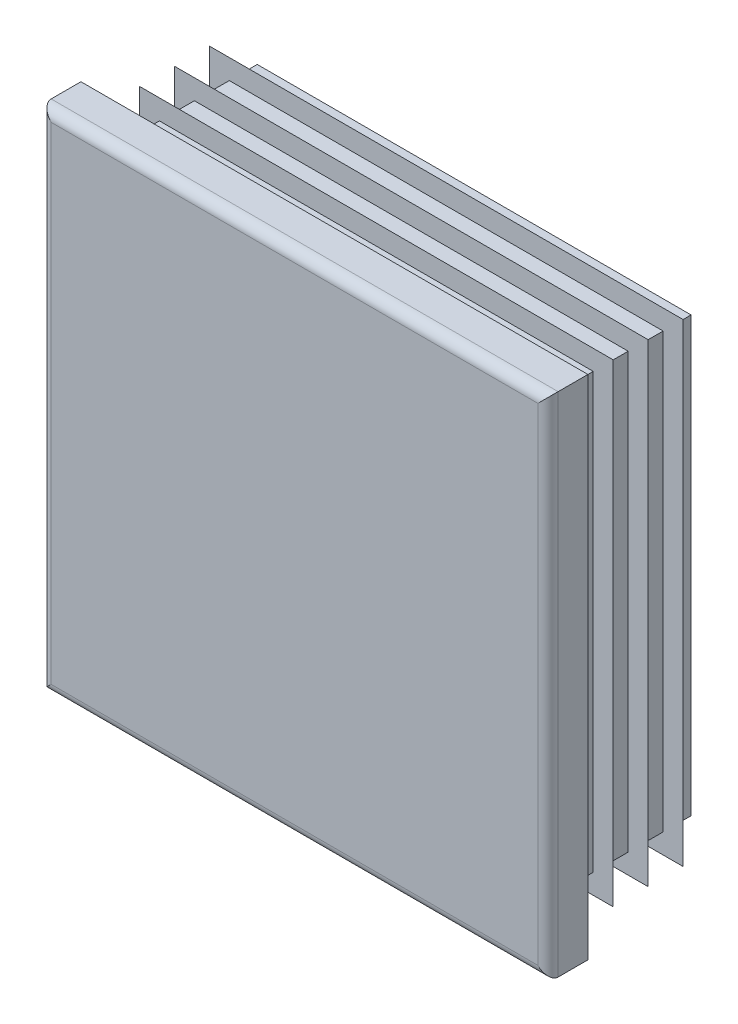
ISO-10303-21;
HEADER;
FILE_DESCRIPTION(('STEP AP214'),'2;1');
FILE_NAME('part.step','',(''),(''),'','','');
FILE_SCHEMA(('AUTOMOTIVE_DESIGN { 1 0 10303 214 1 1 1 1 }'));
ENDSEC;
DATA;
#1=APPLICATION_CONTEXT('core data for automotive mechanical design processes');
#2=APPLICATION_PROTOCOL_DEFINITION('international standard','automotive_design',2000,#1);
#3=PRODUCT_CONTEXT('',#1,'mechanical');
#4=PRODUCT('Part','Part','',(#3));
#5=PRODUCT_RELATED_PRODUCT_CATEGORY('part','',(#4));
#6=PRODUCT_DEFINITION_FORMATION('','',#4);
#7=PRODUCT_DEFINITION_CONTEXT('part definition',#1,'design');
#8=PRODUCT_DEFINITION('design','',#6,#7);
#9=PRODUCT_DEFINITION_SHAPE('','',#8);
#10=(LENGTH_UNIT() NAMED_UNIT(*) SI_UNIT(.MILLI.,.METRE.));
#11=(NAMED_UNIT(*) PLANE_ANGLE_UNIT() SI_UNIT($,.RADIAN.));
#12=(NAMED_UNIT(*) SI_UNIT($,.STERADIAN.) SOLID_ANGLE_UNIT());
#13=UNCERTAINTY_MEASURE_WITH_UNIT(LENGTH_MEASURE(1.E-05),#10,'distance_accuracy_value','');
#14=(GEOMETRIC_REPRESENTATION_CONTEXT(3) GLOBAL_UNCERTAINTY_ASSIGNED_CONTEXT((#13)) GLOBAL_UNIT_ASSIGNED_CONTEXT((#10,
#11,#12)) REPRESENTATION_CONTEXT('',''));
#15=CARTESIAN_POINT('',(0.,0.,0.));
#16=DIRECTION('',(0.,0.,1.));
#17=DIRECTION('',(1.,0.,0.));
#18=AXIS2_PLACEMENT_3D('',#15,#16,#17);
#19=CARTESIAN_POINT('',(36.576,-38.1,6.));
#20=DIRECTION('',(0.,0.,-1.));
#21=DIRECTION('',(0.,1.,0.));
#22=AXIS2_PLACEMENT_3D('',#19,#20,#21);
#23=PLANE('',#22);
#24=DIRECTION('',(0.,1.,0.));
#25=VECTOR('',#24,1.);
#26=CARTESIAN_POINT('',(-36.576,-38.1,6.));
#27=LINE('',#26,#25);
#28=CARTESIAN_POINT('',(-36.576,-36.576,6.));
#29=VERTEX_POINT('',#28);
#30=CARTESIAN_POINT('',(-36.576,36.576,6.));
#31=VERTEX_POINT('',#30);
#32=EDGE_CURVE('E262',#29,#31,#27,.T.);
#33=ORIENTED_EDGE('',*,*,#32,.F.);
#34=DIRECTION('',(-1.,0.,0.));
#35=VECTOR('',#34,1.);
#36=CARTESIAN_POINT('',(38.1,-36.576,6.));
#37=LINE('',#36,#35);
#38=CARTESIAN_POINT('',(36.576,-36.576,6.));
#39=VERTEX_POINT('',#38);
#40=EDGE_CURVE('E432',#39,#29,#37,.T.);
#41=ORIENTED_EDGE('',*,*,#40,.F.);
#42=DIRECTION('',(0.,1.,0.));
#43=VECTOR('',#42,1.);
#44=CARTESIAN_POINT('',(36.576,-38.1,6.));
#45=LINE('',#44,#43);
#46=CARTESIAN_POINT('',(36.576,36.576,6.));
#47=VERTEX_POINT('',#46);
#48=EDGE_CURVE('E257',#39,#47,#45,.T.);
#49=ORIENTED_EDGE('',*,*,#48,.T.);
#50=DIRECTION('',(-1.,0.,0.));
#51=VECTOR('',#50,1.);
#52=CARTESIAN_POINT('',(38.1,36.576,6.));
#53=LINE('',#52,#51);
#54=EDGE_CURVE('E534',#47,#31,#53,.T.);
#55=ORIENTED_EDGE('',*,*,#54,.T.);
#56=EDGE_LOOP('',(#33,#41,#49,#55));
#57=FACE_BOUND('',#56,.T.);
#58=ADVANCED_FACE('F14',(#57),#23,.F.);
#59=CARTESIAN_POINT('',(-36.576,-38.1,4.476));
#60=DIRECTION('',(0.,1.,0.));
#61=DIRECTION('',(-1.,0.,0.));
#62=AXIS2_PLACEMENT_3D('',#59,#60,#61);
#63=CYLINDRICAL_SURFACE('',#62,1.524);
#64=DIRECTION('',(0.,1.,0.));
#65=VECTOR('',#64,1.);
#66=CARTESIAN_POINT('',(-38.1,-38.1,4.476));
#67=LINE('',#66,#65);
#68=CARTESIAN_POINT('',(-38.1,-38.1,4.476));
#69=VERTEX_POINT('',#68);
#70=CARTESIAN_POINT('',(-38.1,38.1,4.476));
#71=VERTEX_POINT('',#70);
#72=EDGE_CURVE('E354',#69,#71,#67,.T.);
#73=ORIENTED_EDGE('',*,*,#72,.F.);
#74=CARTESIAN_POINT('',(-36.576,-36.576,4.476));
#75=DIRECTION('',(-0.707106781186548,0.707106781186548,0.));
#76=DIRECTION('',(0.707106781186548,0.707106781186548,0.));
#77=AXIS2_PLACEMENT_3D('',#74,#75,#76);
#78=ELLIPSE('',#77,2.15526146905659,1.524);
#79=EDGE_CURVE('E59',#69,#29,#78,.T.);
#80=ORIENTED_EDGE('',*,*,#79,.T.);
#81=ORIENTED_EDGE('',*,*,#32,.T.);
#82=CARTESIAN_POINT('',(-36.576,36.576,4.476));
#83=DIRECTION('',(0.707106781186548,0.707106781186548,0.));
#84=DIRECTION('',(-0.707106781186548,0.707106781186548,0.));
#85=AXIS2_PLACEMENT_3D('',#82,#83,#84);
#86=ELLIPSE('',#85,2.1552614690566,1.524);
#87=EDGE_CURVE('E258',#31,#71,#86,.F.);
#88=ORIENTED_EDGE('',*,*,#87,.T.);
#89=EDGE_LOOP('',(#73,#80,#81,#88));
#90=FACE_BOUND('',#89,.T.);
#91=ADVANCED_FACE('F16',(#90),#63,.T.);
#92=CARTESIAN_POINT('',(-38.1,-38.1,4.476));
#93=DIRECTION('',(1.,0.,0.));
#94=DIRECTION('',(0.,1.,0.));
#95=AXIS2_PLACEMENT_3D('',#92,#93,#94);
#96=PLANE('',#95);
#97=DIRECTION('',(0.,0.,-1.));
#98=VECTOR('',#97,1.);
#99=CARTESIAN_POINT('',(-38.1,38.1,4.476));
#100=LINE('',#99,#98);
#101=CARTESIAN_POINT('',(-38.1,38.1,0.));
#102=VERTEX_POINT('',#101);
#103=EDGE_CURVE('E519',#71,#102,#100,.T.);
#104=ORIENTED_EDGE('',*,*,#103,.T.);
#105=DIRECTION('',(0.,1.,0.));
#106=VECTOR('',#105,1.);
#107=CARTESIAN_POINT('',(-38.1,-38.1,0.));
#108=LINE('',#107,#106);
#109=CARTESIAN_POINT('',(-38.1,-38.1,0.));
#110=VERTEX_POINT('',#109);
#111=EDGE_CURVE('E352',#110,#102,#108,.T.);
#112=ORIENTED_EDGE('',*,*,#111,.F.);
#113=DIRECTION('',(0.,0.,-1.));
#114=VECTOR('',#113,1.);
#115=CARTESIAN_POINT('',(-38.1,-38.1,4.476));
#116=LINE('',#115,#114);
#117=EDGE_CURVE('E520',#69,#110,#116,.T.);
#118=ORIENTED_EDGE('',*,*,#117,.F.);
#119=ORIENTED_EDGE('',*,*,#72,.T.);
#120=EDGE_LOOP('',(#104,#112,#118,#119));
#121=FACE_BOUND('',#120,.T.);
#122=ADVANCED_FACE('F604',(#121),#96,.F.);
#123=CARTESIAN_POINT('',(-32.6,-38.1,0.));
#124=DIRECTION('',(1.,0.,0.));
#125=DIRECTION('',(0.,1.,0.));
#126=AXIS2_PLACEMENT_3D('',#123,#124,#125);
#127=PLANE('',#126);
#128=DIRECTION('',(0.,1.,0.));
#129=VECTOR('',#128,1.);
#130=CARTESIAN_POINT('',(-32.6,-38.1,0.));
#131=LINE('',#130,#129);
#132=CARTESIAN_POINT('',(-32.6,-32.6,0.));
#133=VERTEX_POINT('',#132);
#134=CARTESIAN_POINT('',(-32.6,32.6,0.));
#135=VERTEX_POINT('',#134);
#136=EDGE_CURVE('E349',#133,#135,#131,.T.);
#137=ORIENTED_EDGE('',*,*,#136,.T.);
#138=DIRECTION('',(0.,0.,-1.));
#139=VECTOR('',#138,1.);
#140=CARTESIAN_POINT('',(-32.6,32.6,0.));
#141=LINE('',#140,#139);
#142=CARTESIAN_POINT('',(-32.6,32.6,-1.05));
#143=VERTEX_POINT('',#142);
#144=EDGE_CURVE('E445',#135,#143,#141,.T.);
#145=ORIENTED_EDGE('',*,*,#144,.T.);
#146=DIRECTION('',(0.,1.,0.));
#147=VECTOR('',#146,1.);
#148=CARTESIAN_POINT('',(-32.6,-38.1,-1.05));
#149=LINE('',#148,#147);
#150=CARTESIAN_POINT('',(-32.6,-32.6,-1.05));
#151=VERTEX_POINT('',#150);
#152=EDGE_CURVE('E346',#151,#143,#149,.T.);
#153=ORIENTED_EDGE('',*,*,#152,.F.);
#154=DIRECTION('',(0.,0.,1.));
#155=VECTOR('',#154,1.);
#156=CARTESIAN_POINT('',(-32.6,-32.6,0.));
#157=LINE('',#156,#155);
#158=EDGE_CURVE('E439',#151,#133,#157,.T.);
#159=ORIENTED_EDGE('',*,*,#158,.T.);
#160=EDGE_LOOP('',(#137,#145,#153,#159));
#161=FACE_BOUND('',#160,.T.);
#162=ADVANCED_FACE('F728',(#161),#127,.F.);
#163=CARTESIAN_POINT('',(-35.6,-38.1,-1.05));
#164=DIRECTION('',(0.573576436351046,0.,0.819152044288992));
#165=DIRECTION('',(-0.819152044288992,0.,0.573576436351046));
#166=AXIS2_PLACEMENT_3D('',#163,#164,#165);
#167=PLANE('',#166);
#168=DIRECTION('',(0.,1.,0.));
#169=VECTOR('',#168,1.);
#170=CARTESIAN_POINT('',(-35.6,-38.1,-1.05));
#171=LINE('',#170,#169);
#172=CARTESIAN_POINT('',(-35.6,-35.6,-1.05));
#173=VERTEX_POINT('',#172);
#174=CARTESIAN_POINT('',(-35.6,35.6,-1.05));
#175=VERTEX_POINT('',#174);
#176=EDGE_CURVE('E344',#173,#175,#171,.T.);
#177=ORIENTED_EDGE('',*,*,#176,.T.);
#178=DIRECTION('',(0.633687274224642,-0.633687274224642,-0.443712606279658));
#179=VECTOR('',#178,1.);
#180=CARTESIAN_POINT('',(-6.0050603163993,6.00506031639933,-21.7725998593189));
#181=LINE('',#180,#179);
#182=CARTESIAN_POINT('',(-32.6,32.6,-3.15062261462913));
#183=VERTEX_POINT('',#182);
#184=EDGE_CURVE('E457',#175,#183,#181,.T.);
#185=ORIENTED_EDGE('',*,*,#184,.T.);
#186=DIRECTION('',(0.,1.,0.));
#187=VECTOR('',#186,1.);
#188=CARTESIAN_POINT('',(-32.6,-38.1,-3.15062261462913));
#189=LINE('',#188,#187);
#190=CARTESIAN_POINT('',(-32.6,-32.6,-3.15062261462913));
#191=VERTEX_POINT('',#190);
#192=EDGE_CURVE('E341',#191,#183,#189,.T.);
#193=ORIENTED_EDGE('',*,*,#192,.F.);
#194=DIRECTION('',(-0.633687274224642,-0.633687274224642,0.443712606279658));
#195=VECTOR('',#194,1.);
#196=CARTESIAN_POINT('',(-36.6038989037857,-36.6038989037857,-0.347062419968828));
#197=LINE('',#196,#195);
#198=EDGE_CURVE('E451',#191,#173,#197,.T.);
#199=ORIENTED_EDGE('',*,*,#198,.T.);
#200=EDGE_LOOP('',(#177,#185,#193,#199));
#201=FACE_BOUND('',#200,.T.);
#202=ADVANCED_FACE('F732',(#201),#167,.F.);
#203=CARTESIAN_POINT('',(-32.6,-38.1,-3.15062261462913));
#204=DIRECTION('',(1.,0.,0.));
#205=DIRECTION('',(0.,1.,0.));
#206=AXIS2_PLACEMENT_3D('',#203,#204,#205);
#207=PLANE('',#206);
#208=ORIENTED_EDGE('',*,*,#192,.T.);
#209=DIRECTION('',(0.,0.,-1.));
#210=VECTOR('',#209,1.);
#211=CARTESIAN_POINT('',(-32.6,32.6,-3.15062261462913));
#212=LINE('',#211,#210);
#213=CARTESIAN_POINT('',(-32.6,32.6,-6.3));
#214=VERTEX_POINT('',#213);
#215=EDGE_CURVE('E463',#183,#214,#212,.T.);
#216=ORIENTED_EDGE('',*,*,#215,.T.);
#217=DIRECTION('',(0.,1.,0.));
#218=VECTOR('',#217,1.);
#219=CARTESIAN_POINT('',(-32.6,-38.1,-6.3));
#220=LINE('',#219,#218);
#221=CARTESIAN_POINT('',(-32.6,-32.6,-6.3));
#222=VERTEX_POINT('',#221);
#223=EDGE_CURVE('E338',#222,#214,#220,.T.);
#224=ORIENTED_EDGE('',*,*,#223,.F.);
#225=DIRECTION('',(0.,0.,1.));
#226=VECTOR('',#225,1.);
#227=CARTESIAN_POINT('',(-32.6,-32.6,-3.15062261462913));
#228=LINE('',#227,#226);
#229=EDGE_CURVE('E460',#222,#191,#228,.T.);
#230=ORIENTED_EDGE('',*,*,#229,.T.);
#231=EDGE_LOOP('',(#208,#216,#224,#230));
#232=FACE_BOUND('',#231,.T.);
#233=ADVANCED_FACE('F738',(#232),#207,.F.);
#234=CARTESIAN_POINT('',(-35.6,-38.1,-6.3));
#235=DIRECTION('',(0.573576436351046,0.,0.819152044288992));
#236=DIRECTION('',(-0.819152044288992,0.,0.573576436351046));
#237=AXIS2_PLACEMENT_3D('',#234,#235,#236);
#238=PLANE('',#237);
#239=DIRECTION('',(0.,1.,0.));
#240=VECTOR('',#239,1.);
#241=CARTESIAN_POINT('',(-35.6,-38.1,-6.3));
#242=LINE('',#241,#240);
#243=CARTESIAN_POINT('',(-35.6,-35.6,-6.3));
#244=VERTEX_POINT('',#243);
#245=CARTESIAN_POINT('',(-35.6,35.6,-6.3));
#246=VERTEX_POINT('',#245);
#247=EDGE_CURVE('E336',#244,#246,#242,.T.);
#248=ORIENTED_EDGE('',*,*,#247,.T.);
#249=DIRECTION('',(0.633687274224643,-0.633687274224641,-0.443712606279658));
#250=VECTOR('',#249,1.);
#251=CARTESIAN_POINT('',(-6.00506031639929,6.00506031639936,-27.0225998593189));
#252=LINE('',#251,#250);
#253=CARTESIAN_POINT('',(-32.6,32.6,-8.40062261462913));
#254=VERTEX_POINT('',#253);
#255=EDGE_CURVE('E475',#246,#254,#252,.T.);
#256=ORIENTED_EDGE('',*,*,#255,.T.);
#257=DIRECTION('',(0.,1.,0.));
#258=VECTOR('',#257,1.);
#259=CARTESIAN_POINT('',(-32.6,-38.1,-8.40062261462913));
#260=LINE('',#259,#258);
#261=CARTESIAN_POINT('',(-32.6,-32.6,-8.40062261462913));
#262=VERTEX_POINT('',#261);
#263=EDGE_CURVE('E333',#262,#254,#260,.T.);
#264=ORIENTED_EDGE('',*,*,#263,.F.);
#265=DIRECTION('',(-0.633687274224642,-0.633687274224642,0.443712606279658));
#266=VECTOR('',#265,1.);
#267=CARTESIAN_POINT('',(-36.6038989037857,-36.6038989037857,-5.59706241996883));
#268=LINE('',#267,#266);
#269=EDGE_CURVE('E469',#262,#244,#268,.T.);
#270=ORIENTED_EDGE('',*,*,#269,.T.);
#271=EDGE_LOOP('',(#248,#256,#264,#270));
#272=FACE_BOUND('',#271,.T.);
#273=ADVANCED_FACE('F742',(#272),#238,.F.);
#274=CARTESIAN_POINT('',(-32.6,-38.1,-8.40062261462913));
#275=DIRECTION('',(1.,0.,0.));
#276=DIRECTION('',(0.,1.,0.));
#277=AXIS2_PLACEMENT_3D('',#274,#275,#276);
#278=PLANE('',#277);
#279=ORIENTED_EDGE('',*,*,#263,.T.);
#280=DIRECTION('',(0.,0.,-1.));
#281=VECTOR('',#280,1.);
#282=CARTESIAN_POINT('',(-32.6,32.6,-8.40062261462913));
#283=LINE('',#282,#281);
#284=CARTESIAN_POINT('',(-32.6,32.6,-11.55));
#285=VERTEX_POINT('',#284);
#286=EDGE_CURVE('E481',#254,#285,#283,.T.);
#287=ORIENTED_EDGE('',*,*,#286,.T.);
#288=DIRECTION('',(0.,1.,0.));
#289=VECTOR('',#288,1.);
#290=CARTESIAN_POINT('',(-32.6,-38.1,-11.55));
#291=LINE('',#290,#289);
#292=CARTESIAN_POINT('',(-32.6,-32.6,-11.55));
#293=VERTEX_POINT('',#292);
#294=EDGE_CURVE('E330',#293,#285,#291,.T.);
#295=ORIENTED_EDGE('',*,*,#294,.F.);
#296=DIRECTION('',(0.,0.,1.));
#297=VECTOR('',#296,1.);
#298=CARTESIAN_POINT('',(-32.6,-32.6,-8.40062261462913));
#299=LINE('',#298,#297);
#300=EDGE_CURVE('E478',#293,#262,#299,.T.);
#301=ORIENTED_EDGE('',*,*,#300,.T.);
#302=EDGE_LOOP('',(#279,#287,#295,#301));
#303=FACE_BOUND('',#302,.T.);
#304=ADVANCED_FACE('F746',(#303),#278,.F.);
#305=CARTESIAN_POINT('',(-35.6,-38.1,-11.55));
#306=DIRECTION('',(0.573576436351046,0.,0.819152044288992));
#307=DIRECTION('',(-0.819152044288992,0.,0.573576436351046));
#308=AXIS2_PLACEMENT_3D('',#305,#306,#307);
#309=PLANE('',#308);
#310=DIRECTION('',(0.,1.,0.));
#311=VECTOR('',#310,1.);
#312=CARTESIAN_POINT('',(-35.6,-38.1,-11.55));
#313=LINE('',#312,#311);
#314=CARTESIAN_POINT('',(-35.6,-35.6,-11.55));
#315=VERTEX_POINT('',#314);
#316=CARTESIAN_POINT('',(-35.6,35.6,-11.55));
#317=VERTEX_POINT('',#316);
#318=EDGE_CURVE('E328',#315,#317,#313,.T.);
#319=ORIENTED_EDGE('',*,*,#318,.T.);
#320=DIRECTION('',(0.633687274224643,-0.633687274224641,-0.443712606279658));
#321=VECTOR('',#320,1.);
#322=CARTESIAN_POINT('',(-6.00506031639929,6.00506031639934,-32.2725998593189));
#323=LINE('',#322,#321);
#324=CARTESIAN_POINT('',(-32.6,32.6,-13.6506226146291));
#325=VERTEX_POINT('',#324);
#326=EDGE_CURVE('E493',#317,#325,#323,.T.);
#327=ORIENTED_EDGE('',*,*,#326,.T.);
#328=DIRECTION('',(0.,1.,0.));
#329=VECTOR('',#328,1.);
#330=CARTESIAN_POINT('',(-32.6,-38.1,-13.6506226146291));
#331=LINE('',#330,#329);
#332=CARTESIAN_POINT('',(-32.6,-32.6,-13.6506226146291));
#333=VERTEX_POINT('',#332);
#334=EDGE_CURVE('E325',#333,#325,#331,.T.);
#335=ORIENTED_EDGE('',*,*,#334,.F.);
#336=DIRECTION('',(-0.633687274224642,-0.633687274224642,0.443712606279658));
#337=VECTOR('',#336,1.);
#338=CARTESIAN_POINT('',(-36.6038989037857,-36.6038989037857,-10.8470624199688));
#339=LINE('',#338,#337);
#340=EDGE_CURVE('E487',#333,#315,#339,.T.);
#341=ORIENTED_EDGE('',*,*,#340,.T.);
#342=EDGE_LOOP('',(#319,#327,#335,#341));
#343=FACE_BOUND('',#342,.T.);
#344=ADVANCED_FACE('F668',(#343),#309,.F.);
#345=CARTESIAN_POINT('',(-32.6,-38.1,-13.6506226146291));
#346=DIRECTION('',(1.,0.,0.));
#347=DIRECTION('',(0.,1.,0.));
#348=AXIS2_PLACEMENT_3D('',#345,#346,#347);
#349=PLANE('',#348);
#350=ORIENTED_EDGE('',*,*,#334,.T.);
#351=DIRECTION('',(0.,0.,-1.));
#352=VECTOR('',#351,1.);
#353=CARTESIAN_POINT('',(-32.6,32.6,-13.6506226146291));
#354=LINE('',#353,#352);
#355=CARTESIAN_POINT('',(-32.6,32.6,-16.8));
#356=VERTEX_POINT('',#355);
#357=EDGE_CURVE('E499',#325,#356,#354,.T.);
#358=ORIENTED_EDGE('',*,*,#357,.T.);
#359=DIRECTION('',(0.,1.,0.));
#360=VECTOR('',#359,1.);
#361=CARTESIAN_POINT('',(-32.6,-38.1,-16.8));
#362=LINE('',#361,#360);
#363=CARTESIAN_POINT('',(-32.6,-32.6,-16.8));
#364=VERTEX_POINT('',#363);
#365=EDGE_CURVE('E322',#364,#356,#362,.T.);
#366=ORIENTED_EDGE('',*,*,#365,.F.);
#367=DIRECTION('',(0.,0.,1.));
#368=VECTOR('',#367,1.);
#369=CARTESIAN_POINT('',(-32.6,-32.6,-13.6506226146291));
#370=LINE('',#369,#368);
#371=EDGE_CURVE('E496',#364,#333,#370,.T.);
#372=ORIENTED_EDGE('',*,*,#371,.T.);
#373=EDGE_LOOP('',(#350,#358,#366,#372));
#374=FACE_BOUND('',#373,.T.);
#375=ADVANCED_FACE('F665',(#374),#349,.F.);
#376=CARTESIAN_POINT('',(-35.6,-38.1,-16.8));
#377=DIRECTION('',(0.573576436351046,0.,0.819152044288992));
#378=DIRECTION('',(-0.819152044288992,0.,0.573576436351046));
#379=AXIS2_PLACEMENT_3D('',#376,#377,#378);
#380=PLANE('',#379);
#381=DIRECTION('',(0.,1.,0.));
#382=VECTOR('',#381,1.);
#383=CARTESIAN_POINT('',(-35.6,-38.1,-16.8));
#384=LINE('',#383,#382);
#385=CARTESIAN_POINT('',(-35.6,-35.6,-16.8));
#386=VERTEX_POINT('',#385);
#387=CARTESIAN_POINT('',(-35.6,35.6,-16.8));
#388=VERTEX_POINT('',#387);
#389=EDGE_CURVE('E320',#386,#388,#384,.T.);
#390=ORIENTED_EDGE('',*,*,#389,.T.);
#391=DIRECTION('',(0.633687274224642,-0.633687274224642,-0.443712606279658));
#392=VECTOR('',#391,1.);
#393=CARTESIAN_POINT('',(-6.00506031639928,6.00506031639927,-37.5225998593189));
#394=LINE('',#393,#392);
#395=CARTESIAN_POINT('',(-32.6,32.6,-18.9006226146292));
#396=VERTEX_POINT('',#395);
#397=EDGE_CURVE('E511',#388,#396,#394,.T.);
#398=ORIENTED_EDGE('',*,*,#397,.T.);
#399=DIRECTION('',(0.,1.,0.));
#400=VECTOR('',#399,1.);
#401=CARTESIAN_POINT('',(-32.6,-38.1,-18.9006226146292));
#402=LINE('',#401,#400);
#403=CARTESIAN_POINT('',(-32.6,-32.6,-18.9006226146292));
#404=VERTEX_POINT('',#403);
#405=EDGE_CURVE('E317',#404,#396,#402,.T.);
#406=ORIENTED_EDGE('',*,*,#405,.F.);
#407=DIRECTION('',(-0.633687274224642,-0.633687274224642,0.443712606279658));
#408=VECTOR('',#407,1.);
#409=CARTESIAN_POINT('',(-36.6038989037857,-36.6038989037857,-16.0970624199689));
#410=LINE('',#409,#408);
#411=EDGE_CURVE('E505',#404,#386,#410,.T.);
#412=ORIENTED_EDGE('',*,*,#411,.T.);
#413=EDGE_LOOP('',(#390,#398,#406,#412));
#414=FACE_BOUND('',#413,.T.);
#415=ADVANCED_FACE('F580',(#414),#380,.F.);
#416=CARTESIAN_POINT('',(-32.6,-38.1,-18.9006226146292));
#417=DIRECTION('',(1.,0.,0.));
#418=DIRECTION('',(0.,1.,0.));
#419=AXIS2_PLACEMENT_3D('',#416,#417,#418);
#420=PLANE('',#419);
#421=ORIENTED_EDGE('',*,*,#405,.T.);
#422=DIRECTION('',(0.,0.,-1.));
#423=VECTOR('',#422,1.);
#424=CARTESIAN_POINT('',(-32.6,32.6,-18.9006226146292));
#425=LINE('',#424,#423);
#426=CARTESIAN_POINT('',(-32.6,32.6,-21.));
#427=VERTEX_POINT('',#426);
#428=EDGE_CURVE('E517',#396,#427,#425,.T.);
#429=ORIENTED_EDGE('',*,*,#428,.T.);
#430=DIRECTION('',(0.,1.,0.));
#431=VECTOR('',#430,1.);
#432=CARTESIAN_POINT('',(-32.6,-38.1,-21.));
#433=LINE('',#432,#431);
#434=CARTESIAN_POINT('',(-32.6,-32.6,-21.));
#435=VERTEX_POINT('',#434);
#436=EDGE_CURVE('E314',#435,#427,#433,.T.);
#437=ORIENTED_EDGE('',*,*,#436,.F.);
#438=DIRECTION('',(0.,0.,1.));
#439=VECTOR('',#438,1.);
#440=CARTESIAN_POINT('',(-32.6,-32.6,-18.9006226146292));
#441=LINE('',#440,#439);
#442=EDGE_CURVE('E514',#435,#404,#441,.T.);
#443=ORIENTED_EDGE('',*,*,#442,.T.);
#444=EDGE_LOOP('',(#421,#429,#437,#443));
#445=FACE_BOUND('',#444,.T.);
#446=ADVANCED_FACE('F582',(#445),#420,.F.);
#447=CARTESIAN_POINT('',(-32.6,-38.1,-21.));
#448=DIRECTION('',(0.,0.,1.));
#449=DIRECTION('',(0.,-1.,0.));
#450=AXIS2_PLACEMENT_3D('',#447,#448,#449);
#451=PLANE('',#450);
#452=ORIENTED_EDGE('',*,*,#436,.T.);
#453=DIRECTION('',(-1.,0.,0.));
#454=VECTOR('',#453,1.);
#455=CARTESIAN_POINT('',(38.1,32.6,-21.));
#456=LINE('',#455,#454);
#457=CARTESIAN_POINT('',(32.6,32.6,-21.));
#458=VERTEX_POINT('',#457);
#459=EDGE_CURVE('E388',#458,#427,#456,.T.);
#460=ORIENTED_EDGE('',*,*,#459,.F.);
#461=DIRECTION('',(0.,1.,0.));
#462=VECTOR('',#461,1.);
#463=CARTESIAN_POINT('',(32.6,-38.1,-21.));
#464=LINE('',#463,#462);
#465=CARTESIAN_POINT('',(32.6,-32.6,-21.));
#466=VERTEX_POINT('',#465);
#467=EDGE_CURVE('E311',#466,#458,#464,.T.);
#468=ORIENTED_EDGE('',*,*,#467,.F.);
#469=DIRECTION('',(-1.,0.,0.));
#470=VECTOR('',#469,1.);
#471=CARTESIAN_POINT('',(38.1,-32.6,-21.));
#472=LINE('',#471,#470);
#473=EDGE_CURVE('E386',#466,#435,#472,.T.);
#474=ORIENTED_EDGE('',*,*,#473,.T.);
#475=EDGE_LOOP('',(#452,#460,#468,#474));
#476=FACE_BOUND('',#475,.T.);
#477=ADVANCED_FACE('F385',(#476),#451,.F.);
#478=CARTESIAN_POINT('',(32.6,-38.1,-21.));
#479=DIRECTION('',(-1.,0.,0.));
#480=DIRECTION('',(0.,-1.,0.));
#481=AXIS2_PLACEMENT_3D('',#478,#479,#480);
#482=PLANE('',#481);
#483=ORIENTED_EDGE('',*,*,#467,.T.);
#484=DIRECTION('',(0.,0.,1.));
#485=VECTOR('',#484,1.);
#486=CARTESIAN_POINT('',(32.6,32.6,-21.));
#487=LINE('',#486,#485);
#488=CARTESIAN_POINT('',(32.6,32.6,-18.9006226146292));
#489=VERTEX_POINT('',#488);
#490=EDGE_CURVE('E9',#458,#489,#487,.T.);
#491=ORIENTED_EDGE('',*,*,#490,.T.);
#492=DIRECTION('',(0.,1.,0.));
#493=VECTOR('',#492,1.);
#494=CARTESIAN_POINT('',(32.6,-38.1,-18.9006226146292));
#495=LINE('',#494,#493);
#496=CARTESIAN_POINT('',(32.6,-32.6,-18.9006226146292));
#497=VERTEX_POINT('',#496);
#498=EDGE_CURVE('E308',#497,#489,#495,.T.);
#499=ORIENTED_EDGE('',*,*,#498,.F.);
#500=DIRECTION('',(0.,0.,-1.));
#501=VECTOR('',#500,1.);
#502=CARTESIAN_POINT('',(32.6,-32.6,-21.));
#503=LINE('',#502,#501);
#504=EDGE_CURVE('E23',#497,#466,#503,.T.);
#505=ORIENTED_EDGE('',*,*,#504,.T.);
#506=EDGE_LOOP('',(#483,#491,#499,#505));
#507=FACE_BOUND('',#506,.T.);
#508=ADVANCED_FACE('F378',(#507),#482,.F.);
#509=CARTESIAN_POINT('',(32.6,-38.1,-18.9006226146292));
#510=DIRECTION('',(-0.573576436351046,0.,0.819152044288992));
#511=DIRECTION('',(-0.819152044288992,0.,-0.573576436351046));
#512=AXIS2_PLACEMENT_3D('',#509,#510,#511);
#513=PLANE('',#512);
#514=ORIENTED_EDGE('',*,*,#498,.T.);
#515=DIRECTION('',(0.633687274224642,0.633687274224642,0.443712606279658));
#516=VECTOR('',#515,1.);
#517=CARTESIAN_POINT('',(4.20973900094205,4.20973900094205,-38.7796973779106));
#518=LINE('',#517,#516);
#519=CARTESIAN_POINT('',(35.6,35.6,-16.8));
#520=VERTEX_POINT('',#519);
#521=EDGE_CURVE('E508',#489,#520,#518,.T.);
#522=ORIENTED_EDGE('',*,*,#521,.T.);
#523=DIRECTION('',(0.,1.,0.));
#524=VECTOR('',#523,1.);
#525=CARTESIAN_POINT('',(35.6,-38.1,-16.8));
#526=LINE('',#525,#524);
#527=CARTESIAN_POINT('',(35.6,-35.6,-16.8));
#528=VERTEX_POINT('',#527);
#529=EDGE_CURVE('E305',#528,#520,#526,.T.);
#530=ORIENTED_EDGE('',*,*,#529,.F.);
#531=DIRECTION('',(-0.633687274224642,0.633687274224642,-0.443712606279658));
#532=VECTOR('',#531,1.);
#533=CARTESIAN_POINT('',(34.8085775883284,-34.8085775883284,-17.3541599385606));
#534=LINE('',#533,#532);
#535=EDGE_CURVE('E502',#528,#497,#534,.T.);
#536=ORIENTED_EDGE('',*,*,#535,.T.);
#537=EDGE_LOOP('',(#514,#522,#530,#536));
#538=FACE_BOUND('',#537,.T.);
#539=ADVANCED_FACE('F588',(#538),#513,.F.);
#540=CARTESIAN_POINT('',(35.6,-38.1,-16.8));
#541=DIRECTION('',(0.,0.,-1.));
#542=DIRECTION('',(0.,1.,0.));
#543=AXIS2_PLACEMENT_3D('',#540,#541,#542);
#544=PLANE('',#543);
#545=ORIENTED_EDGE('',*,*,#529,.T.);
#546=DIRECTION('',(-1.,0.,0.));
#547=VECTOR('',#546,1.);
#548=CARTESIAN_POINT('',(38.1,35.6,-16.8));
#549=LINE('',#548,#547);
#550=EDGE_CURVE('E394',#520,#388,#549,.T.);
#551=ORIENTED_EDGE('',*,*,#550,.T.);
#552=ORIENTED_EDGE('',*,*,#389,.F.);
#553=DIRECTION('',(-1.,0.,0.));
#554=VECTOR('',#553,1.);
#555=CARTESIAN_POINT('',(38.1,-35.6,-16.8));
#556=LINE('',#555,#554);
#557=EDGE_CURVE('E401',#528,#386,#556,.T.);
#558=ORIENTED_EDGE('',*,*,#557,.F.);
#559=EDGE_LOOP('',(#545,#551,#552,#558));
#560=FACE_BOUND('',#559,.T.);
#561=ORIENTED_EDGE('',*,*,#365,.T.);
#562=DIRECTION('',(-1.,0.,0.));
#563=VECTOR('',#562,1.);
#564=CARTESIAN_POINT('',(38.1,32.6,-16.8));
#565=LINE('',#564,#563);
#566=CARTESIAN_POINT('',(32.6,32.6,-16.8));
#567=VERTEX_POINT('',#566);
#568=EDGE_CURVE('E567',#567,#356,#565,.T.);
#569=ORIENTED_EDGE('',*,*,#568,.F.);
#570=DIRECTION('',(0.,1.,0.));
#571=VECTOR('',#570,1.);
#572=CARTESIAN_POINT('',(32.6,-38.1,-16.8));
#573=LINE('',#572,#571);
#574=CARTESIAN_POINT('',(32.6,-32.6,-16.8));
#575=VERTEX_POINT('',#574);
#576=EDGE_CURVE('E302',#575,#567,#573,.T.);
#577=ORIENTED_EDGE('',*,*,#576,.F.);
#578=DIRECTION('',(-1.,0.,0.));
#579=VECTOR('',#578,1.);
#580=CARTESIAN_POINT('',(38.1,-32.6,-16.8));
#581=LINE('',#580,#579);
#582=EDGE_CURVE('E403',#575,#364,#581,.T.);
#583=ORIENTED_EDGE('',*,*,#582,.T.);
#584=EDGE_LOOP('',(#561,#569,#577,#583));
#585=FACE_BOUND('',#584,.T.);
#586=ADVANCED_FACE('F571',(#560,#585),#544,.F.);
#587=CARTESIAN_POINT('',(32.6,-38.1,-16.8));
#588=DIRECTION('',(-1.,0.,0.));
#589=DIRECTION('',(0.,-1.,0.));
#590=AXIS2_PLACEMENT_3D('',#587,#588,#589);
#591=PLANE('',#590);
#592=ORIENTED_EDGE('',*,*,#576,.T.);
#593=DIRECTION('',(0.,0.,1.));
#594=VECTOR('',#593,1.);
#595=CARTESIAN_POINT('',(32.6,32.6,-16.8));
#596=LINE('',#595,#594);
#597=CARTESIAN_POINT('',(32.6,32.6,-13.6506226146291));
#598=VERTEX_POINT('',#597);
#599=EDGE_CURVE('E372',#567,#598,#596,.T.);
#600=ORIENTED_EDGE('',*,*,#599,.T.);
#601=DIRECTION('',(0.,1.,0.));
#602=VECTOR('',#601,1.);
#603=CARTESIAN_POINT('',(32.6,-38.1,-13.6506226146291));
#604=LINE('',#603,#602);
#605=CARTESIAN_POINT('',(32.6,-32.6,-13.6506226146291));
#606=VERTEX_POINT('',#605);
#607=EDGE_CURVE('E299',#606,#598,#604,.T.);
#608=ORIENTED_EDGE('',*,*,#607,.F.);
#609=DIRECTION('',(0.,0.,-1.));
#610=VECTOR('',#609,1.);
#611=CARTESIAN_POINT('',(32.6,-32.6,-16.8));
#612=LINE('',#611,#610);
#613=EDGE_CURVE('E369',#606,#575,#612,.T.);
#614=ORIENTED_EDGE('',*,*,#613,.T.);
#615=EDGE_LOOP('',(#592,#600,#608,#614));
#616=FACE_BOUND('',#615,.T.);
#617=ADVANCED_FACE('F596',(#616),#591,.F.);
#618=CARTESIAN_POINT('',(32.6,-38.1,-13.6506226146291));
#619=DIRECTION('',(-0.573576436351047,0.,0.819152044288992));
#620=DIRECTION('',(-0.819152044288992,0.,-0.573576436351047));
#621=AXIS2_PLACEMENT_3D('',#618,#619,#620);
#622=PLANE('',#621);
#623=ORIENTED_EDGE('',*,*,#607,.T.);
#624=DIRECTION('',(0.633687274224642,0.633687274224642,0.443712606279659));
#625=VECTOR('',#624,1.);
#626=CARTESIAN_POINT('',(4.20973900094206,4.20973900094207,-33.5296973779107));
#627=LINE('',#626,#625);
#628=CARTESIAN_POINT('',(35.6,35.6,-11.55));
#629=VERTEX_POINT('',#628);
#630=EDGE_CURVE('E490',#598,#629,#627,.T.);
#631=ORIENTED_EDGE('',*,*,#630,.T.);
#632=DIRECTION('',(0.,1.,0.));
#633=VECTOR('',#632,1.);
#634=CARTESIAN_POINT('',(35.6,-38.1,-11.55));
#635=LINE('',#634,#633);
#636=CARTESIAN_POINT('',(35.6,-35.6,-11.55));
#637=VERTEX_POINT('',#636);
#638=EDGE_CURVE('E296',#637,#629,#635,.T.);
#639=ORIENTED_EDGE('',*,*,#638,.F.);
#640=DIRECTION('',(-0.633687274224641,0.633687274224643,-0.443712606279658));
#641=VECTOR('',#640,1.);
#642=CARTESIAN_POINT('',(34.8085775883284,-34.8085775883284,-12.1041599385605));
#643=LINE('',#642,#641);
#644=EDGE_CURVE('E484',#637,#606,#643,.T.);
#645=ORIENTED_EDGE('',*,*,#644,.T.);
#646=EDGE_LOOP('',(#623,#631,#639,#645));
#647=FACE_BOUND('',#646,.T.);
#648=ADVANCED_FACE('F648',(#647),#622,.F.);
#649=CARTESIAN_POINT('',(35.6,-38.1,-11.55));
#650=DIRECTION('',(0.,0.,-1.));
#651=DIRECTION('',(0.,1.,0.));
#652=AXIS2_PLACEMENT_3D('',#649,#650,#651);
#653=PLANE('',#652);
#654=ORIENTED_EDGE('',*,*,#638,.T.);
#655=DIRECTION('',(-1.,0.,0.));
#656=VECTOR('',#655,1.);
#657=CARTESIAN_POINT('',(38.1,35.6,-11.55));
#658=LINE('',#657,#656);
#659=EDGE_CURVE('E561',#629,#317,#658,.T.);
#660=ORIENTED_EDGE('',*,*,#659,.T.);
#661=ORIENTED_EDGE('',*,*,#318,.F.);
#662=DIRECTION('',(-1.,0.,0.));
#663=VECTOR('',#662,1.);
#664=CARTESIAN_POINT('',(38.1,-35.6,-11.55));
#665=LINE('',#664,#663);
#666=EDGE_CURVE('E409',#637,#315,#665,.T.);
#667=ORIENTED_EDGE('',*,*,#666,.F.);
#668=EDGE_LOOP('',(#654,#660,#661,#667));
#669=FACE_BOUND('',#668,.T.);
#670=ORIENTED_EDGE('',*,*,#294,.T.);
#671=DIRECTION('',(-1.,0.,0.));
#672=VECTOR('',#671,1.);
#673=CARTESIAN_POINT('',(38.1,32.6,-11.55));
#674=LINE('',#673,#672);
#675=CARTESIAN_POINT('',(32.6,32.6,-11.55));
#676=VERTEX_POINT('',#675);
#677=EDGE_CURVE('E559',#676,#285,#674,.T.);
#678=ORIENTED_EDGE('',*,*,#677,.F.);
#679=DIRECTION('',(0.,1.,0.));
#680=VECTOR('',#679,1.);
#681=CARTESIAN_POINT('',(32.6,-38.1,-11.55));
#682=LINE('',#681,#680);
#683=CARTESIAN_POINT('',(32.6,-32.6,-11.55));
#684=VERTEX_POINT('',#683);
#685=EDGE_CURVE('E293',#684,#676,#682,.T.);
#686=ORIENTED_EDGE('',*,*,#685,.F.);
#687=DIRECTION('',(-1.,0.,0.));
#688=VECTOR('',#687,1.);
#689=CARTESIAN_POINT('',(38.1,-32.6,-11.55));
#690=LINE('',#689,#688);
#691=EDGE_CURVE('E411',#684,#293,#690,.T.);
#692=ORIENTED_EDGE('',*,*,#691,.T.);
#693=EDGE_LOOP('',(#670,#678,#686,#692));
#694=FACE_BOUND('',#693,.T.);
#695=ADVANCED_FACE('F644',(#669,#694),#653,.F.);
#696=CARTESIAN_POINT('',(32.6,-38.1,-11.55));
#697=DIRECTION('',(-1.,0.,0.));
#698=DIRECTION('',(0.,-1.,0.));
#699=AXIS2_PLACEMENT_3D('',#696,#697,#698);
#700=PLANE('',#699);
#701=ORIENTED_EDGE('',*,*,#685,.T.);
#702=DIRECTION('',(0.,0.,1.));
#703=VECTOR('',#702,1.);
#704=CARTESIAN_POINT('',(32.6,32.6,-11.55));
#705=LINE('',#704,#703);
#706=CARTESIAN_POINT('',(32.6,32.6,-8.40062261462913));
#707=VERTEX_POINT('',#706);
#708=EDGE_CURVE('E366',#676,#707,#705,.T.);
#709=ORIENTED_EDGE('',*,*,#708,.T.);
#710=DIRECTION('',(0.,1.,0.));
#711=VECTOR('',#710,1.);
#712=CARTESIAN_POINT('',(32.6,-38.1,-8.40062261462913));
#713=LINE('',#712,#711);
#714=CARTESIAN_POINT('',(32.6,-32.6,-8.40062261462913));
#715=VERTEX_POINT('',#714);
#716=EDGE_CURVE('E290',#715,#707,#713,.T.);
#717=ORIENTED_EDGE('',*,*,#716,.F.);
#718=DIRECTION('',(0.,0.,-1.));
#719=VECTOR('',#718,1.);
#720=CARTESIAN_POINT('',(32.6,-32.6,-11.55));
#721=LINE('',#720,#719);
#722=EDGE_CURVE('E363',#715,#684,#721,.T.);
#723=ORIENTED_EDGE('',*,*,#722,.T.);
#724=EDGE_LOOP('',(#701,#709,#717,#723));
#725=FACE_BOUND('',#724,.T.);
#726=ADVANCED_FACE('F640',(#725),#700,.F.);
#727=CARTESIAN_POINT('',(32.6,-38.1,-8.40062261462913));
#728=DIRECTION('',(-0.573576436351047,0.,0.819152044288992));
#729=DIRECTION('',(-0.819152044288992,0.,-0.573576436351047));
#730=AXIS2_PLACEMENT_3D('',#727,#728,#729);
#731=PLANE('',#730);
#732=ORIENTED_EDGE('',*,*,#716,.T.);
#733=DIRECTION('',(0.633687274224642,0.633687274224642,0.443712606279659));
#734=VECTOR('',#733,1.);
#735=CARTESIAN_POINT('',(4.20973900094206,4.20973900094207,-28.2796973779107));
#736=LINE('',#735,#734);
#737=CARTESIAN_POINT('',(35.6,35.6,-6.3));
#738=VERTEX_POINT('',#737);
#739=EDGE_CURVE('E472',#707,#738,#736,.T.);
#740=ORIENTED_EDGE('',*,*,#739,.T.);
#741=DIRECTION('',(0.,1.,0.));
#742=VECTOR('',#741,1.);
#743=CARTESIAN_POINT('',(35.6,-38.1,-6.3));
#744=LINE('',#743,#742);
#745=CARTESIAN_POINT('',(35.6,-35.6,-6.3));
#746=VERTEX_POINT('',#745);
#747=EDGE_CURVE('E287',#746,#738,#744,.T.);
#748=ORIENTED_EDGE('',*,*,#747,.F.);
#749=DIRECTION('',(-0.633687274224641,0.633687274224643,-0.443712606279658));
#750=VECTOR('',#749,1.);
#751=CARTESIAN_POINT('',(34.8085775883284,-34.8085775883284,-6.85415993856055));
#752=LINE('',#751,#750);
#753=EDGE_CURVE('E466',#746,#715,#752,.T.);
#754=ORIENTED_EDGE('',*,*,#753,.T.);
#755=EDGE_LOOP('',(#732,#740,#748,#754));
#756=FACE_BOUND('',#755,.T.);
#757=ADVANCED_FACE('F636',(#756),#731,.F.);
#758=CARTESIAN_POINT('',(35.6,-38.1,-6.3));
#759=DIRECTION('',(0.,0.,-1.));
#760=DIRECTION('',(0.,1.,0.));
#761=AXIS2_PLACEMENT_3D('',#758,#759,#760);
#762=PLANE('',#761);
#763=ORIENTED_EDGE('',*,*,#747,.T.);
#764=DIRECTION('',(-1.,0.,0.));
#765=VECTOR('',#764,1.);
#766=CARTESIAN_POINT('',(38.1,35.6,-6.3));
#767=LINE('',#766,#765);
#768=EDGE_CURVE('E553',#738,#246,#767,.T.);
#769=ORIENTED_EDGE('',*,*,#768,.T.);
#770=ORIENTED_EDGE('',*,*,#247,.F.);
#771=DIRECTION('',(-1.,0.,0.));
#772=VECTOR('',#771,1.);
#773=CARTESIAN_POINT('',(38.1,-35.6,-6.3));
#774=LINE('',#773,#772);
#775=EDGE_CURVE('E417',#746,#244,#774,.T.);
#776=ORIENTED_EDGE('',*,*,#775,.F.);
#777=EDGE_LOOP('',(#763,#769,#770,#776));
#778=FACE_BOUND('',#777,.T.);
#779=ORIENTED_EDGE('',*,*,#223,.T.);
#780=DIRECTION('',(-1.,0.,0.));
#781=VECTOR('',#780,1.);
#782=CARTESIAN_POINT('',(38.1,32.6,-6.3));
#783=LINE('',#782,#781);
#784=CARTESIAN_POINT('',(32.6,32.6,-6.3));
#785=VERTEX_POINT('',#784);
#786=EDGE_CURVE('E551',#785,#214,#783,.T.);
#787=ORIENTED_EDGE('',*,*,#786,.F.);
#788=DIRECTION('',(0.,1.,0.));
#789=VECTOR('',#788,1.);
#790=CARTESIAN_POINT('',(32.6,-38.1,-6.3));
#791=LINE('',#790,#789);
#792=CARTESIAN_POINT('',(32.6,-32.6,-6.3));
#793=VERTEX_POINT('',#792);
#794=EDGE_CURVE('E284',#793,#785,#791,.T.);
#795=ORIENTED_EDGE('',*,*,#794,.F.);
#796=DIRECTION('',(-1.,0.,0.));
#797=VECTOR('',#796,1.);
#798=CARTESIAN_POINT('',(38.1,-32.6,-6.3));
#799=LINE('',#798,#797);
#800=EDGE_CURVE('E419',#793,#222,#799,.T.);
#801=ORIENTED_EDGE('',*,*,#800,.T.);
#802=EDGE_LOOP('',(#779,#787,#795,#801));
#803=FACE_BOUND('',#802,.T.);
#804=ADVANCED_FACE('F632',(#778,#803),#762,.F.);
#805=CARTESIAN_POINT('',(32.6,-38.1,-6.3));
#806=DIRECTION('',(-1.,0.,0.));
#807=DIRECTION('',(0.,-1.,0.));
#808=AXIS2_PLACEMENT_3D('',#805,#806,#807);
#809=PLANE('',#808);
#810=ORIENTED_EDGE('',*,*,#794,.T.);
#811=DIRECTION('',(0.,0.,1.));
#812=VECTOR('',#811,1.);
#813=CARTESIAN_POINT('',(32.6,32.6,-6.3));
#814=LINE('',#813,#812);
#815=CARTESIAN_POINT('',(32.6,32.6,-3.15062261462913));
#816=VERTEX_POINT('',#815);
#817=EDGE_CURVE('E360',#785,#816,#814,.T.);
#818=ORIENTED_EDGE('',*,*,#817,.T.);
#819=DIRECTION('',(0.,1.,0.));
#820=VECTOR('',#819,1.);
#821=CARTESIAN_POINT('',(32.6,-38.1,-3.15062261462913));
#822=LINE('',#821,#820);
#823=CARTESIAN_POINT('',(32.6,-32.6,-3.15062261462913));
#824=VERTEX_POINT('',#823);
#825=EDGE_CURVE('E281',#824,#816,#822,.T.);
#826=ORIENTED_EDGE('',*,*,#825,.F.);
#827=DIRECTION('',(0.,0.,-1.));
#828=VECTOR('',#827,1.);
#829=CARTESIAN_POINT('',(32.6,-32.6,-6.3));
#830=LINE('',#829,#828);
#831=EDGE_CURVE('E357',#824,#793,#830,.T.);
#832=ORIENTED_EDGE('',*,*,#831,.T.);
#833=EDGE_LOOP('',(#810,#818,#826,#832));
#834=FACE_BOUND('',#833,.T.);
#835=ADVANCED_FACE('F628',(#834),#809,.F.);
#836=CARTESIAN_POINT('',(32.6,-38.1,-3.15062261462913));
#837=DIRECTION('',(-0.573576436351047,0.,0.819152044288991));
#838=DIRECTION('',(-0.819152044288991,0.,-0.573576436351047));
#839=AXIS2_PLACEMENT_3D('',#836,#837,#838);
#840=PLANE('',#839);
#841=ORIENTED_EDGE('',*,*,#825,.T.);
#842=DIRECTION('',(0.633687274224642,0.633687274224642,0.443712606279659));
#843=VECTOR('',#842,1.);
#844=CARTESIAN_POINT('',(4.20973900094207,4.20973900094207,-23.0296973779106));
#845=LINE('',#844,#843);
#846=CARTESIAN_POINT('',(35.6,35.6,-1.05));
#847=VERTEX_POINT('',#846);
#848=EDGE_CURVE('E454',#816,#847,#845,.T.);
#849=ORIENTED_EDGE('',*,*,#848,.T.);
#850=DIRECTION('',(0.,1.,0.));
#851=VECTOR('',#850,1.);
#852=CARTESIAN_POINT('',(35.6,-38.1,-1.05));
#853=LINE('',#852,#851);
#854=CARTESIAN_POINT('',(35.6,-35.6,-1.05));
#855=VERTEX_POINT('',#854);
#856=EDGE_CURVE('E278',#855,#847,#853,.T.);
#857=ORIENTED_EDGE('',*,*,#856,.F.);
#858=DIRECTION('',(-0.633687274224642,0.633687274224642,-0.443712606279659));
#859=VECTOR('',#858,1.);
#860=CARTESIAN_POINT('',(34.8085775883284,-34.8085775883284,-1.60415993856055));
#861=LINE('',#860,#859);
#862=EDGE_CURVE('E448',#855,#824,#861,.T.);
#863=ORIENTED_EDGE('',*,*,#862,.T.);
#864=EDGE_LOOP('',(#841,#849,#857,#863));
#865=FACE_BOUND('',#864,.T.);
#866=ADVANCED_FACE('F624',(#865),#840,.F.);
#867=CARTESIAN_POINT('',(35.6,-38.1,-1.05));
#868=DIRECTION('',(0.,0.,-1.));
#869=DIRECTION('',(1.,0.,0.));
#870=AXIS2_PLACEMENT_3D('',#867,#868,#869);
#871=PLANE('',#870);
#872=ORIENTED_EDGE('',*,*,#856,.T.);
#873=DIRECTION('',(-1.,0.,0.));
#874=VECTOR('',#873,1.);
#875=CARTESIAN_POINT('',(38.1,35.6,-1.05));
#876=LINE('',#875,#874);
#877=EDGE_CURVE('E545',#847,#175,#876,.T.);
#878=ORIENTED_EDGE('',*,*,#877,.T.);
#879=ORIENTED_EDGE('',*,*,#176,.F.);
#880=DIRECTION('',(-1.,0.,0.));
#881=VECTOR('',#880,1.);
#882=CARTESIAN_POINT('',(38.1,-35.6,-1.05));
#883=LINE('',#882,#881);
#884=EDGE_CURVE('E425',#855,#173,#883,.T.);
#885=ORIENTED_EDGE('',*,*,#884,.F.);
#886=EDGE_LOOP('',(#872,#878,#879,#885));
#887=FACE_BOUND('',#886,.T.);
#888=ORIENTED_EDGE('',*,*,#152,.T.);
#889=DIRECTION('',(-1.,0.,0.));
#890=VECTOR('',#889,1.);
#891=CARTESIAN_POINT('',(38.1,32.6,-1.05));
#892=LINE('',#891,#890);
#893=CARTESIAN_POINT('',(32.6,32.6,-1.05));
#894=VERTEX_POINT('',#893);
#895=EDGE_CURVE('E543',#894,#143,#892,.T.);
#896=ORIENTED_EDGE('',*,*,#895,.F.);
#897=DIRECTION('',(0.,1.,0.));
#898=VECTOR('',#897,1.);
#899=CARTESIAN_POINT('',(32.6,-38.1,-1.05));
#900=LINE('',#899,#898);
#901=CARTESIAN_POINT('',(32.6,-32.6,-1.05));
#902=VERTEX_POINT('',#901);
#903=EDGE_CURVE('E275',#902,#894,#900,.T.);
#904=ORIENTED_EDGE('',*,*,#903,.F.);
#905=DIRECTION('',(-1.,0.,0.));
#906=VECTOR('',#905,1.);
#907=CARTESIAN_POINT('',(38.1,-32.6,-1.05));
#908=LINE('',#907,#906);
#909=EDGE_CURVE('E427',#902,#151,#908,.T.);
#910=ORIENTED_EDGE('',*,*,#909,.T.);
#911=EDGE_LOOP('',(#888,#896,#904,#910));
#912=FACE_BOUND('',#911,.T.);
#913=ADVANCED_FACE('F620',(#887,#912),#871,.F.);
#914=CARTESIAN_POINT('',(32.6,-38.1,-1.05));
#915=DIRECTION('',(-1.,0.,0.));
#916=DIRECTION('',(0.,-1.,0.));
#917=AXIS2_PLACEMENT_3D('',#914,#915,#916);
#918=PLANE('',#917);
#919=ORIENTED_EDGE('',*,*,#903,.T.);
#920=DIRECTION('',(0.,0.,1.));
#921=VECTOR('',#920,1.);
#922=CARTESIAN_POINT('',(32.6,32.6,-1.05));
#923=LINE('',#922,#921);
#924=CARTESIAN_POINT('',(32.6,32.6,0.));
#925=VERTEX_POINT('',#924);
#926=EDGE_CURVE('E442',#894,#925,#923,.T.);
#927=ORIENTED_EDGE('',*,*,#926,.T.);
#928=DIRECTION('',(0.,1.,0.));
#929=VECTOR('',#928,1.);
#930=CARTESIAN_POINT('',(32.6,-38.1,0.));
#931=LINE('',#930,#929);
#932=CARTESIAN_POINT('',(32.6,-32.6,0.));
#933=VERTEX_POINT('',#932);
#934=EDGE_CURVE('E268',#933,#925,#931,.T.);
#935=ORIENTED_EDGE('',*,*,#934,.F.);
#936=DIRECTION('',(0.,0.,-1.));
#937=VECTOR('',#936,1.);
#938=CARTESIAN_POINT('',(32.6,-32.6,-1.05));
#939=LINE('',#938,#937);
#940=EDGE_CURVE('E436',#933,#902,#939,.T.);
#941=ORIENTED_EDGE('',*,*,#940,.T.);
#942=EDGE_LOOP('',(#919,#927,#935,#941));
#943=FACE_BOUND('',#942,.T.);
#944=ADVANCED_FACE('F616',(#943),#918,.F.);
#945=CARTESIAN_POINT('',(32.6,-38.1,0.));
#946=DIRECTION('',(0.,0.,1.));
#947=DIRECTION('',(0.,-1.,0.));
#948=AXIS2_PLACEMENT_3D('',#945,#946,#947);
#949=PLANE('',#948);
#950=DIRECTION('',(-1.,0.,0.));
#951=VECTOR('',#950,1.);
#952=CARTESIAN_POINT('',(38.1,32.6,0.));
#953=LINE('',#952,#951);
#954=EDGE_CURVE('E538',#925,#135,#953,.T.);
#955=ORIENTED_EDGE('',*,*,#954,.T.);
#956=ORIENTED_EDGE('',*,*,#136,.F.);
#957=DIRECTION('',(-1.,0.,0.));
#958=VECTOR('',#957,1.);
#959=CARTESIAN_POINT('',(38.1,-32.6,0.));
#960=LINE('',#959,#958);
#961=EDGE_CURVE('E248',#933,#133,#960,.T.);
#962=ORIENTED_EDGE('',*,*,#961,.F.);
#963=ORIENTED_EDGE('',*,*,#934,.T.);
#964=EDGE_LOOP('',(#955,#956,#962,#963));
#965=FACE_BOUND('',#964,.T.);
#966=ORIENTED_EDGE('',*,*,#111,.T.);
#967=DIRECTION('',(1.,0.,0.));
#968=VECTOR('',#967,1.);
#969=CARTESIAN_POINT('',(32.6,38.1,0.));
#970=LINE('',#969,#968);
#971=CARTESIAN_POINT('',(38.1,38.1,0.));
#972=VERTEX_POINT('',#971);
#973=EDGE_CURVE('E525',#102,#972,#970,.T.);
#974=ORIENTED_EDGE('',*,*,#973,.T.);
#975=DIRECTION('',(0.,1.,0.));
#976=VECTOR('',#975,1.);
#977=CARTESIAN_POINT('',(38.1,-38.1,0.));
#978=LINE('',#977,#976);
#979=CARTESIAN_POINT('',(38.1,-38.1,0.));
#980=VERTEX_POINT('',#979);
#981=EDGE_CURVE('E45',#980,#972,#978,.T.);
#982=ORIENTED_EDGE('',*,*,#981,.F.);
#983=DIRECTION('',(1.,0.,0.));
#984=VECTOR('',#983,1.);
#985=CARTESIAN_POINT('',(-38.1,-38.1,0.));
#986=LINE('',#985,#984);
#987=EDGE_CURVE('E31',#110,#980,#986,.T.);
#988=ORIENTED_EDGE('',*,*,#987,.F.);
#989=EDGE_LOOP('',(#966,#974,#982,#988));
#990=FACE_BOUND('',#989,.T.);
#991=ADVANCED_FACE('F613',(#965,#990),#949,.F.);
#992=CARTESIAN_POINT('',(38.1,-38.1,0.));
#993=DIRECTION('',(-1.,0.,0.));
#994=DIRECTION('',(0.,-1.,0.));
#995=AXIS2_PLACEMENT_3D('',#992,#993,#994);
#996=PLANE('',#995);
#997=DIRECTION('',(0.,0.,1.));
#998=VECTOR('',#997,1.);
#999=CARTESIAN_POINT('',(38.1,38.1,0.));
#1000=LINE('',#999,#998);
#1001=CARTESIAN_POINT('',(38.1,38.1,4.476));
#1002=VERTEX_POINT('',#1001);
#1003=EDGE_CURVE('E266',#972,#1002,#1000,.T.);
#1004=ORIENTED_EDGE('',*,*,#1003,.T.);
#1005=DIRECTION('',(0.,1.,0.));
#1006=VECTOR('',#1005,1.);
#1007=CARTESIAN_POINT('',(38.1,-38.1,4.476));
#1008=LINE('',#1007,#1006);
#1009=CARTESIAN_POINT('',(38.1,-38.1,4.476));
#1010=VERTEX_POINT('',#1009);
#1011=EDGE_CURVE('E255',#1010,#1002,#1008,.T.);
#1012=ORIENTED_EDGE('',*,*,#1011,.F.);
#1013=DIRECTION('',(0.,0.,1.));
#1014=VECTOR('',#1013,1.);
#1015=CARTESIAN_POINT('',(38.1,-38.1,0.));
#1016=LINE('',#1015,#1014);
#1017=EDGE_CURVE('E260',#980,#1010,#1016,.T.);
#1018=ORIENTED_EDGE('',*,*,#1017,.F.);
#1019=ORIENTED_EDGE('',*,*,#981,.T.);
#1020=EDGE_LOOP('',(#1004,#1012,#1018,#1019));
#1021=FACE_BOUND('',#1020,.T.);
#1022=ADVANCED_FACE('F264',(#1021),#996,.F.);
#1023=CARTESIAN_POINT('',(36.576,-38.1,4.476));
#1024=DIRECTION('',(0.,1.,0.));
#1025=DIRECTION('',(-1.,0.,0.));
#1026=AXIS2_PLACEMENT_3D('',#1023,#1024,#1025);
#1027=CYLINDRICAL_SURFACE('',#1026,1.524);
#1028=ORIENTED_EDGE('',*,*,#48,.F.);
#1029=CARTESIAN_POINT('',(36.576,-36.576,4.476));
#1030=DIRECTION('',(0.707106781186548,0.707106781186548,0.));
#1031=DIRECTION('',(-0.707106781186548,0.707106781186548,0.));
#1032=AXIS2_PLACEMENT_3D('',#1029,#1030,#1031);
#1033=ELLIPSE('',#1032,2.1552614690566,1.524);
#1034=EDGE_CURVE('E245',#39,#1010,#1033,.T.);
#1035=ORIENTED_EDGE('',*,*,#1034,.T.);
#1036=ORIENTED_EDGE('',*,*,#1011,.T.);
#1037=CARTESIAN_POINT('',(36.576,36.576,4.476));
#1038=DIRECTION('',(-0.707106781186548,0.707106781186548,0.));
#1039=DIRECTION('',(0.707106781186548,0.707106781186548,0.));
#1040=AXIS2_PLACEMENT_3D('',#1037,#1038,#1039);
#1041=ELLIPSE('',#1040,2.1552614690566,1.524);
#1042=EDGE_CURVE('E52',#1002,#47,#1041,.F.);
#1043=ORIENTED_EDGE('',*,*,#1042,.T.);
#1044=EDGE_LOOP('',(#1028,#1035,#1036,#1043));
#1045=FACE_BOUND('',#1044,.T.);
#1046=ADVANCED_FACE('F253',(#1045),#1027,.T.);
#1047=CARTESIAN_POINT('',(-36.576,-38.1,4.476));
#1048=DIRECTION('',(0.,-1.,0.));
#1049=DIRECTION('',(1.,0.,0.));
#1050=AXIS2_PLACEMENT_3D('',#1047,#1048,#1049);
#1051=PLANE('',#1050);
#1052=DIRECTION('',(-1.,0.,0.));
#1053=VECTOR('',#1052,1.);
#1054=CARTESIAN_POINT('',(38.1,-38.1,4.476));
#1055=LINE('',#1054,#1053);
#1056=EDGE_CURVE('E242',#1010,#69,#1055,.T.);
#1057=ORIENTED_EDGE('',*,*,#1056,.T.);
#1058=ORIENTED_EDGE('',*,*,#117,.T.);
#1059=ORIENTED_EDGE('',*,*,#987,.T.);
#1060=ORIENTED_EDGE('',*,*,#1017,.T.);
#1061=EDGE_LOOP('',(#1057,#1058,#1059,#1060));
#1062=FACE_BOUND('',#1061,.T.);
#1063=ADVANCED_FACE('F261',(#1062),#1051,.T.);
#1064=CARTESIAN_POINT('',(-36.576,38.1,4.476));
#1065=DIRECTION('',(0.,-1.,0.));
#1066=DIRECTION('',(1.,0.,0.));
#1067=AXIS2_PLACEMENT_3D('',#1064,#1065,#1066);
#1068=PLANE('',#1067);
#1069=ORIENTED_EDGE('',*,*,#103,.F.);
#1070=DIRECTION('',(-1.,0.,0.));
#1071=VECTOR('',#1070,1.);
#1072=CARTESIAN_POINT('',(38.1,38.1,4.476));
#1073=LINE('',#1072,#1071);
#1074=EDGE_CURVE('E535',#1002,#71,#1073,.T.);
#1075=ORIENTED_EDGE('',*,*,#1074,.F.);
#1076=ORIENTED_EDGE('',*,*,#1003,.F.);
#1077=ORIENTED_EDGE('',*,*,#973,.F.);
#1078=EDGE_LOOP('',(#1069,#1075,#1076,#1077));
#1079=FACE_BOUND('',#1078,.T.);
#1080=ADVANCED_FACE('F607',(#1079),#1068,.F.);
#1081=CARTESIAN_POINT('',(38.1,32.6,-1.05));
#1082=DIRECTION('',(0.,-1.,0.));
#1083=DIRECTION('',(1.,0.,0.));
#1084=AXIS2_PLACEMENT_3D('',#1081,#1082,#1083);
#1085=PLANE('',#1084);
#1086=ORIENTED_EDGE('',*,*,#954,.F.);
#1087=ORIENTED_EDGE('',*,*,#926,.F.);
#1088=ORIENTED_EDGE('',*,*,#895,.T.);
#1089=ORIENTED_EDGE('',*,*,#144,.F.);
#1090=EDGE_LOOP('',(#1086,#1087,#1088,#1089));
#1091=FACE_BOUND('',#1090,.T.);
#1092=ADVANCED_FACE('F715',(#1091),#1085,.F.);
#1093=CARTESIAN_POINT('',(38.1,32.6,-3.15062261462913));
#1094=DIRECTION('',(0.,-0.573576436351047,0.819152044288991));
#1095=DIRECTION('',(0.,-0.819152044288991,-0.573576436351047));
#1096=AXIS2_PLACEMENT_3D('',#1093,#1094,#1095);
#1097=PLANE('',#1096);
#1098=ORIENTED_EDGE('',*,*,#877,.F.);
#1099=ORIENTED_EDGE('',*,*,#848,.F.);
#1100=DIRECTION('',(-1.,0.,0.));
#1101=VECTOR('',#1100,1.);
#1102=CARTESIAN_POINT('',(38.1,32.6,-3.15062261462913));
#1103=LINE('',#1102,#1101);
#1104=EDGE_CURVE('E548',#816,#183,#1103,.T.);
#1105=ORIENTED_EDGE('',*,*,#1104,.T.);
#1106=ORIENTED_EDGE('',*,*,#184,.F.);
#1107=EDGE_LOOP('',(#1098,#1099,#1105,#1106));
#1108=FACE_BOUND('',#1107,.T.);
#1109=ADVANCED_FACE('F720',(#1108),#1097,.F.);
#1110=CARTESIAN_POINT('',(38.1,32.6,-6.3));
#1111=DIRECTION('',(0.,-1.,0.));
#1112=DIRECTION('',(1.,0.,0.));
#1113=AXIS2_PLACEMENT_3D('',#1110,#1111,#1112);
#1114=PLANE('',#1113);
#1115=ORIENTED_EDGE('',*,*,#1104,.F.);
#1116=ORIENTED_EDGE('',*,*,#817,.F.);
#1117=ORIENTED_EDGE('',*,*,#786,.T.);
#1118=ORIENTED_EDGE('',*,*,#215,.F.);
#1119=EDGE_LOOP('',(#1115,#1116,#1117,#1118));
#1120=FACE_BOUND('',#1119,.T.);
#1121=ADVANCED_FACE('F882',(#1120),#1114,.F.);
#1122=CARTESIAN_POINT('',(38.1,32.6,-8.40062261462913));
#1123=DIRECTION('',(0.,-0.573576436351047,0.819152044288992));
#1124=DIRECTION('',(0.,-0.819152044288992,-0.573576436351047));
#1125=AXIS2_PLACEMENT_3D('',#1122,#1123,#1124);
#1126=PLANE('',#1125);
#1127=ORIENTED_EDGE('',*,*,#768,.F.);
#1128=ORIENTED_EDGE('',*,*,#739,.F.);
#1129=DIRECTION('',(-1.,0.,0.));
#1130=VECTOR('',#1129,1.);
#1131=CARTESIAN_POINT('',(38.1,32.6,-8.40062261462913));
#1132=LINE('',#1131,#1130);
#1133=EDGE_CURVE('E556',#707,#254,#1132,.T.);
#1134=ORIENTED_EDGE('',*,*,#1133,.T.);
#1135=ORIENTED_EDGE('',*,*,#255,.F.);
#1136=EDGE_LOOP('',(#1127,#1128,#1134,#1135));
#1137=FACE_BOUND('',#1136,.T.);
#1138=ADVANCED_FACE('F892',(#1137),#1126,.F.);
#1139=CARTESIAN_POINT('',(38.1,32.6,-11.55));
#1140=DIRECTION('',(0.,-1.,0.));
#1141=DIRECTION('',(1.,0.,0.));
#1142=AXIS2_PLACEMENT_3D('',#1139,#1140,#1141);
#1143=PLANE('',#1142);
#1144=ORIENTED_EDGE('',*,*,#1133,.F.);
#1145=ORIENTED_EDGE('',*,*,#708,.F.);
#1146=ORIENTED_EDGE('',*,*,#677,.T.);
#1147=ORIENTED_EDGE('',*,*,#286,.F.);
#1148=EDGE_LOOP('',(#1144,#1145,#1146,#1147));
#1149=FACE_BOUND('',#1148,.T.);
#1150=ADVANCED_FACE('F902',(#1149),#1143,.F.);
#1151=CARTESIAN_POINT('',(38.1,32.6,-13.6506226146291));
#1152=DIRECTION('',(0.,-0.573576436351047,0.819152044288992));
#1153=DIRECTION('',(0.,-0.819152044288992,-0.573576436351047));
#1154=AXIS2_PLACEMENT_3D('',#1151,#1152,#1153);
#1155=PLANE('',#1154);
#1156=ORIENTED_EDGE('',*,*,#659,.F.);
#1157=ORIENTED_EDGE('',*,*,#630,.F.);
#1158=DIRECTION('',(-1.,0.,0.));
#1159=VECTOR('',#1158,1.);
#1160=CARTESIAN_POINT('',(38.1,32.6,-13.6506226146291));
#1161=LINE('',#1160,#1159);
#1162=EDGE_CURVE('E564',#598,#325,#1161,.T.);
#1163=ORIENTED_EDGE('',*,*,#1162,.T.);
#1164=ORIENTED_EDGE('',*,*,#326,.F.);
#1165=EDGE_LOOP('',(#1156,#1157,#1163,#1164));
#1166=FACE_BOUND('',#1165,.T.);
#1167=ADVANCED_FACE('F672',(#1166),#1155,.F.);
#1168=CARTESIAN_POINT('',(38.1,32.6,-16.8));
#1169=DIRECTION('',(0.,-1.,0.));
#1170=DIRECTION('',(1.,0.,0.));
#1171=AXIS2_PLACEMENT_3D('',#1168,#1169,#1170);
#1172=PLANE('',#1171);
#1173=ORIENTED_EDGE('',*,*,#1162,.F.);
#1174=ORIENTED_EDGE('',*,*,#599,.F.);
#1175=ORIENTED_EDGE('',*,*,#568,.T.);
#1176=ORIENTED_EDGE('',*,*,#357,.F.);
#1177=EDGE_LOOP('',(#1173,#1174,#1175,#1176));
#1178=FACE_BOUND('',#1177,.T.);
#1179=ADVANCED_FACE('F663',(#1178),#1172,.F.);
#1180=CARTESIAN_POINT('',(38.1,32.6,-18.9006226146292));
#1181=DIRECTION('',(0.,-0.573576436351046,0.819152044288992));
#1182=DIRECTION('',(0.,-0.819152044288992,-0.573576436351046));
#1183=AXIS2_PLACEMENT_3D('',#1180,#1181,#1182);
#1184=PLANE('',#1183);
#1185=ORIENTED_EDGE('',*,*,#550,.F.);
#1186=ORIENTED_EDGE('',*,*,#521,.F.);
#1187=DIRECTION('',(-1.,0.,0.));
#1188=VECTOR('',#1187,1.);
#1189=CARTESIAN_POINT('',(38.1,32.6,-18.9006226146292));
#1190=LINE('',#1189,#1188);
#1191=EDGE_CURVE('E391',#489,#396,#1190,.T.);
#1192=ORIENTED_EDGE('',*,*,#1191,.T.);
#1193=ORIENTED_EDGE('',*,*,#397,.F.);
#1194=EDGE_LOOP('',(#1185,#1186,#1192,#1193));
#1195=FACE_BOUND('',#1194,.T.);
#1196=ADVANCED_FACE('F576',(#1195),#1184,.F.);
#1197=CARTESIAN_POINT('',(38.1,32.6,-21.));
#1198=DIRECTION('',(0.,-1.,0.));
#1199=DIRECTION('',(1.,0.,0.));
#1200=AXIS2_PLACEMENT_3D('',#1197,#1198,#1199);
#1201=PLANE('',#1200);
#1202=ORIENTED_EDGE('',*,*,#1191,.F.);
#1203=ORIENTED_EDGE('',*,*,#490,.F.);
#1204=ORIENTED_EDGE('',*,*,#459,.T.);
#1205=ORIENTED_EDGE('',*,*,#428,.F.);
#1206=EDGE_LOOP('',(#1202,#1203,#1204,#1205));
#1207=FACE_BOUND('',#1206,.T.);
#1208=ADVANCED_FACE('F937',(#1207),#1201,.F.);
#1209=CARTESIAN_POINT('',(38.1,36.576,4.476));
#1210=DIRECTION('',(-1.,0.,0.));
#1211=DIRECTION('',(0.,-1.,0.));
#1212=AXIS2_PLACEMENT_3D('',#1209,#1210,#1211);
#1213=CYLINDRICAL_SURFACE('',#1212,1.524);
#1214=ORIENTED_EDGE('',*,*,#54,.F.);
#1215=ORIENTED_EDGE('',*,*,#1042,.F.);
#1216=ORIENTED_EDGE('',*,*,#1074,.T.);
#1217=ORIENTED_EDGE('',*,*,#87,.F.);
#1218=EDGE_LOOP('',(#1214,#1215,#1216,#1217));
#1219=FACE_BOUND('',#1218,.T.);
#1220=ADVANCED_FACE('F709',(#1219),#1213,.T.);
#1221=CARTESIAN_POINT('',(38.1,-32.6,0.));
#1222=DIRECTION('',(0.,1.,0.));
#1223=DIRECTION('',(-1.,0.,0.));
#1224=AXIS2_PLACEMENT_3D('',#1221,#1222,#1223);
#1225=PLANE('',#1224);
#1226=ORIENTED_EDGE('',*,*,#909,.F.);
#1227=ORIENTED_EDGE('',*,*,#940,.F.);
#1228=ORIENTED_EDGE('',*,*,#961,.T.);
#1229=ORIENTED_EDGE('',*,*,#158,.F.);
#1230=EDGE_LOOP('',(#1226,#1227,#1228,#1229));
#1231=FACE_BOUND('',#1230,.T.);
#1232=ADVANCED_FACE('F706',(#1231),#1225,.F.);
#1233=CARTESIAN_POINT('',(38.1,-35.6,-1.05));
#1234=DIRECTION('',(0.,0.573576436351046,0.819152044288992));
#1235=DIRECTION('',(0.,-0.819152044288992,0.573576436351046));
#1236=AXIS2_PLACEMENT_3D('',#1233,#1234,#1235);
#1237=PLANE('',#1236);
#1238=DIRECTION('',(-1.,0.,0.));
#1239=VECTOR('',#1238,1.);
#1240=CARTESIAN_POINT('',(38.1,-32.6,-3.15062261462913));
#1241=LINE('',#1240,#1239);
#1242=EDGE_CURVE('E422',#824,#191,#1241,.T.);
#1243=ORIENTED_EDGE('',*,*,#1242,.F.);
#1244=ORIENTED_EDGE('',*,*,#862,.F.);
#1245=ORIENTED_EDGE('',*,*,#884,.T.);
#1246=ORIENTED_EDGE('',*,*,#198,.F.);
#1247=EDGE_LOOP('',(#1243,#1244,#1245,#1246));
#1248=FACE_BOUND('',#1247,.T.);
#1249=ADVANCED_FACE('F702',(#1248),#1237,.F.);
#1250=CARTESIAN_POINT('',(38.1,-32.6,-3.15062261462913));
#1251=DIRECTION('',(0.,1.,0.));
#1252=DIRECTION('',(-1.,0.,0.));
#1253=AXIS2_PLACEMENT_3D('',#1250,#1251,#1252);
#1254=PLANE('',#1253);
#1255=ORIENTED_EDGE('',*,*,#800,.F.);
#1256=ORIENTED_EDGE('',*,*,#831,.F.);
#1257=ORIENTED_EDGE('',*,*,#1242,.T.);
#1258=ORIENTED_EDGE('',*,*,#229,.F.);
#1259=EDGE_LOOP('',(#1255,#1256,#1257,#1258));
#1260=FACE_BOUND('',#1259,.T.);
#1261=ADVANCED_FACE('F698',(#1260),#1254,.F.);
#1262=CARTESIAN_POINT('',(38.1,-35.6,-6.3));
#1263=DIRECTION('',(0.,0.573576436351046,0.819152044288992));
#1264=DIRECTION('',(0.,-0.819152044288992,0.573576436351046));
#1265=AXIS2_PLACEMENT_3D('',#1262,#1263,#1264);
#1266=PLANE('',#1265);
#1267=DIRECTION('',(-1.,0.,0.));
#1268=VECTOR('',#1267,1.);
#1269=CARTESIAN_POINT('',(38.1,-32.6,-8.40062261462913));
#1270=LINE('',#1269,#1268);
#1271=EDGE_CURVE('E414',#715,#262,#1270,.T.);
#1272=ORIENTED_EDGE('',*,*,#1271,.F.);
#1273=ORIENTED_EDGE('',*,*,#753,.F.);
#1274=ORIENTED_EDGE('',*,*,#775,.T.);
#1275=ORIENTED_EDGE('',*,*,#269,.F.);
#1276=EDGE_LOOP('',(#1272,#1273,#1274,#1275));
#1277=FACE_BOUND('',#1276,.T.);
#1278=ADVANCED_FACE('F694',(#1277),#1266,.F.);
#1279=CARTESIAN_POINT('',(38.1,-32.6,-8.40062261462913));
#1280=DIRECTION('',(0.,1.,0.));
#1281=DIRECTION('',(-1.,0.,0.));
#1282=AXIS2_PLACEMENT_3D('',#1279,#1280,#1281);
#1283=PLANE('',#1282);
#1284=ORIENTED_EDGE('',*,*,#691,.F.);
#1285=ORIENTED_EDGE('',*,*,#722,.F.);
#1286=ORIENTED_EDGE('',*,*,#1271,.T.);
#1287=ORIENTED_EDGE('',*,*,#300,.F.);
#1288=EDGE_LOOP('',(#1284,#1285,#1286,#1287));
#1289=FACE_BOUND('',#1288,.T.);
#1290=ADVANCED_FACE('F688',(#1289),#1283,.F.);
#1291=CARTESIAN_POINT('',(38.1,-35.6,-11.55));
#1292=DIRECTION('',(0.,0.573576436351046,0.819152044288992));
#1293=DIRECTION('',(0.,-0.819152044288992,0.573576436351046));
#1294=AXIS2_PLACEMENT_3D('',#1291,#1292,#1293);
#1295=PLANE('',#1294);
#1296=DIRECTION('',(-1.,0.,0.));
#1297=VECTOR('',#1296,1.);
#1298=CARTESIAN_POINT('',(38.1,-32.6,-13.6506226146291));
#1299=LINE('',#1298,#1297);
#1300=EDGE_CURVE('E406',#606,#333,#1299,.T.);
#1301=ORIENTED_EDGE('',*,*,#1300,.F.);
#1302=ORIENTED_EDGE('',*,*,#644,.F.);
#1303=ORIENTED_EDGE('',*,*,#666,.T.);
#1304=ORIENTED_EDGE('',*,*,#340,.F.);
#1305=EDGE_LOOP('',(#1301,#1302,#1303,#1304));
#1306=FACE_BOUND('',#1305,.T.);
#1307=ADVANCED_FACE('F678',(#1306),#1295,.F.);
#1308=CARTESIAN_POINT('',(38.1,-32.6,-13.6506226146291));
#1309=DIRECTION('',(0.,1.,0.));
#1310=DIRECTION('',(-1.,0.,0.));
#1311=AXIS2_PLACEMENT_3D('',#1308,#1309,#1310);
#1312=PLANE('',#1311);
#1313=ORIENTED_EDGE('',*,*,#582,.F.);
#1314=ORIENTED_EDGE('',*,*,#613,.F.);
#1315=ORIENTED_EDGE('',*,*,#1300,.T.);
#1316=ORIENTED_EDGE('',*,*,#371,.F.);
#1317=EDGE_LOOP('',(#1313,#1314,#1315,#1316));
#1318=FACE_BOUND('',#1317,.T.);
#1319=ADVANCED_FACE('F680',(#1318),#1312,.F.);
#1320=CARTESIAN_POINT('',(38.1,-35.6,-16.8));
#1321=DIRECTION('',(0.,0.573576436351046,0.819152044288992));
#1322=DIRECTION('',(0.,-0.819152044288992,0.573576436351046));
#1323=AXIS2_PLACEMENT_3D('',#1320,#1321,#1322);
#1324=PLANE('',#1323);
#1325=DIRECTION('',(-1.,0.,0.));
#1326=VECTOR('',#1325,1.);
#1327=CARTESIAN_POINT('',(38.1,-32.6,-18.9006226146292));
#1328=LINE('',#1327,#1326);
#1329=EDGE_CURVE('E396',#497,#404,#1328,.T.);
#1330=ORIENTED_EDGE('',*,*,#1329,.F.);
#1331=ORIENTED_EDGE('',*,*,#535,.F.);
#1332=ORIENTED_EDGE('',*,*,#557,.T.);
#1333=ORIENTED_EDGE('',*,*,#411,.F.);
#1334=EDGE_LOOP('',(#1330,#1331,#1332,#1333));
#1335=FACE_BOUND('',#1334,.T.);
#1336=ADVANCED_FACE('F586',(#1335),#1324,.F.);
#1337=CARTESIAN_POINT('',(38.1,-32.6,-18.9006226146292));
#1338=DIRECTION('',(0.,1.,0.));
#1339=DIRECTION('',(-1.,0.,0.));
#1340=AXIS2_PLACEMENT_3D('',#1337,#1338,#1339);
#1341=PLANE('',#1340);
#1342=ORIENTED_EDGE('',*,*,#473,.F.);
#1343=ORIENTED_EDGE('',*,*,#504,.F.);
#1344=ORIENTED_EDGE('',*,*,#1329,.T.);
#1345=ORIENTED_EDGE('',*,*,#442,.F.);
#1346=EDGE_LOOP('',(#1342,#1343,#1344,#1345));
#1347=FACE_BOUND('',#1346,.T.);
#1348=ADVANCED_FACE('F583',(#1347),#1341,.F.);
#1349=CARTESIAN_POINT('',(38.1,-36.576,4.476));
#1350=DIRECTION('',(-1.,0.,0.));
#1351=DIRECTION('',(0.,-1.,0.));
#1352=AXIS2_PLACEMENT_3D('',#1349,#1350,#1351);
#1353=CYLINDRICAL_SURFACE('',#1352,1.524);
#1354=ORIENTED_EDGE('',*,*,#1056,.F.);
#1355=ORIENTED_EDGE('',*,*,#1034,.F.);
#1356=ORIENTED_EDGE('',*,*,#40,.T.);
#1357=ORIENTED_EDGE('',*,*,#79,.F.);
#1358=EDGE_LOOP('',(#1354,#1355,#1356,#1357));
#1359=FACE_BOUND('',#1358,.T.);
#1360=ADVANCED_FACE('F244',(#1359),#1353,.T.);
#1361=CLOSED_SHELL('',(#58,#91,#122,#162,#202,#233,#273,#304,#344,#375,#415,#446,#477,#508,#539,
#586,#617,#648,#695,#726,#757,#804,#835,#866,#913,#944,#991,#1022,#1046,#1063,#1080,#1092,#1109,
#1121,#1138,#1150,#1167,#1179,#1196,#1208,#1220,#1232,#1249,#1261,#1278,#1290,#1307,#1319,#1336,
#1348,#1360));
#1362=MANIFOLD_SOLID_BREP('B1',#1361);
#1363=ADVANCED_BREP_SHAPE_REPRESENTATION('',(#18,#1362),#14);
#1364=SHAPE_DEFINITION_REPRESENTATION(#9,#1363);
ENDSEC;
END-ISO-10303-21;
